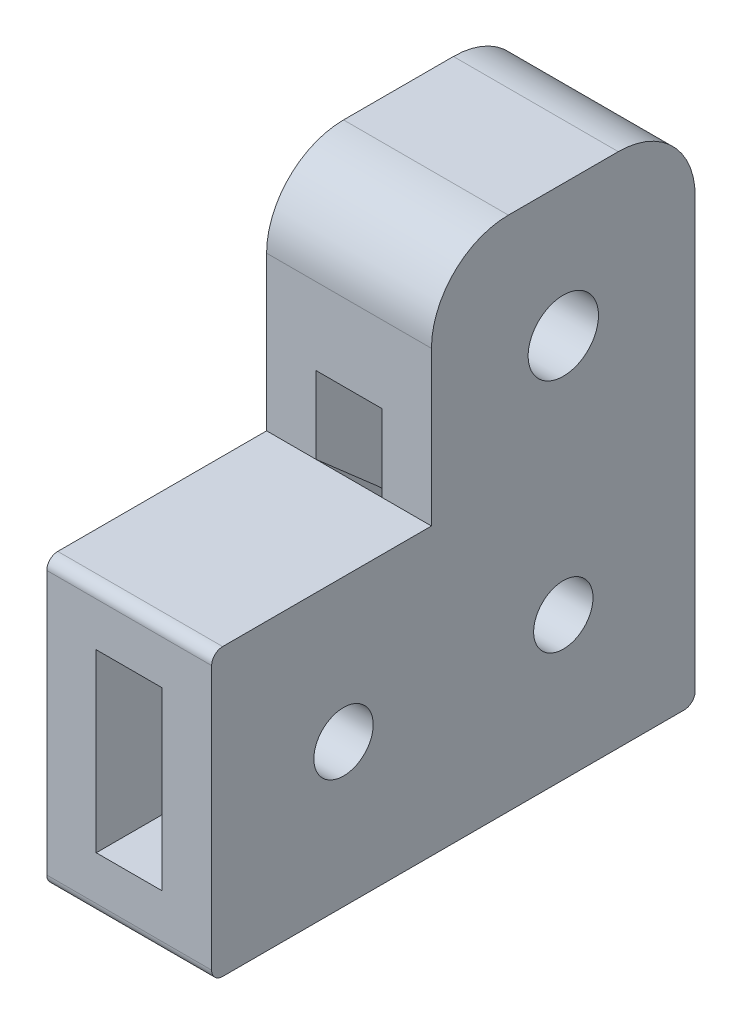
from build123d import *

# Parameters (mm, degrees)
SKETCH_1_R          = 2.7
SKETCH_1_R_2        = 3.2
EXTRUDE_1_DEPTH     = 7.5
FILLET_2_R          = 7
SKETCH_4_W          = 6
SKETCH_4_H          = 16
CUT_EXTRUDE_1_DEPTH = 52.655106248
FILLET_3_R          = 1


with BuildPart() as part:
    # Sketch 1 → Extrude 1 (new, symmetric)
    with BuildSketch(Plane.YZ):
        Polygon((-21, 20), (-21, -24), (26, -24), (26, 0), (5, 0), (5, 20), align=None)
        with Locations(Location((-8, 8, 0), (0, 0, 270))):
            Circle(SKETCH_1_R, mode=Mode.SUBTRACT)
        with Locations(Location((-8, -12, 0), (0, 0, 270))):
            Circle(SKETCH_1_R, mode=Mode.SUBTRACT)
        with Locations(Location((14, -12, 0), (0, 0, 270))):
            Circle(SKETCH_1_R_2, mode=Mode.SUBTRACT)
    extrude(amount=EXTRUDE_1_DEPTH, both=True)

    # Sketch 3 → Loft 1 section 0
    with BuildSketch(Plane(origin=(0, 0, -24), x_dir=(1, 0, 0), z_dir=(0, 0, -1))):
        with BuildLine():
            Line((-3, 16), (3, 16))
            Line((3, 16), (3, 0))
            Line((3, 0), (-3, 0))
            Line((-3, 0), (-3, 16))
        make_face()
    # Sketch 2 → Loft 1 section 1
    with BuildSketch(Plane.XY):
        with BuildLine():
            Line((-3, 12), (3, 12))
            Line((3, 12), (3, 5))
            Line((3, 5), (-3, 5))
            Line((-3, 5), (-3, 12))
        make_face()
    loft(mode=Mode.SUBTRACT)

    # Fillet 2
    fillet_2_edges = [part.edges().sort_by_distance(p)[0] for p in [
        (0, 26, 0),
        (0, 26, -24),
    ]]
    fillet(fillet_2_edges, radius=FILLET_2_R)

    # Sketch 4 → Cut-Extrude 1 (cut, through all)
    with BuildSketch(Plane(origin=(0, 0, -24), x_dir=(1, 0, 0), z_dir=(0, 0, -1))):
        with Locations((0, 8)):
            Rectangle(SKETCH_4_W, SKETCH_4_H)
    extrude(amount=-CUT_EXTRUDE_1_DEPTH, mode=Mode.SUBTRACT)

    # Fillet 3
    fillet_3_edges = [part.edges().sort_by_distance(p)[0] for p in [
        (0, 5, 20),
        (0, -21, -24),
        (0, -21, 20),
    ]]
    fillet(fillet_3_edges, radius=FILLET_3_R)


solid = part.part
